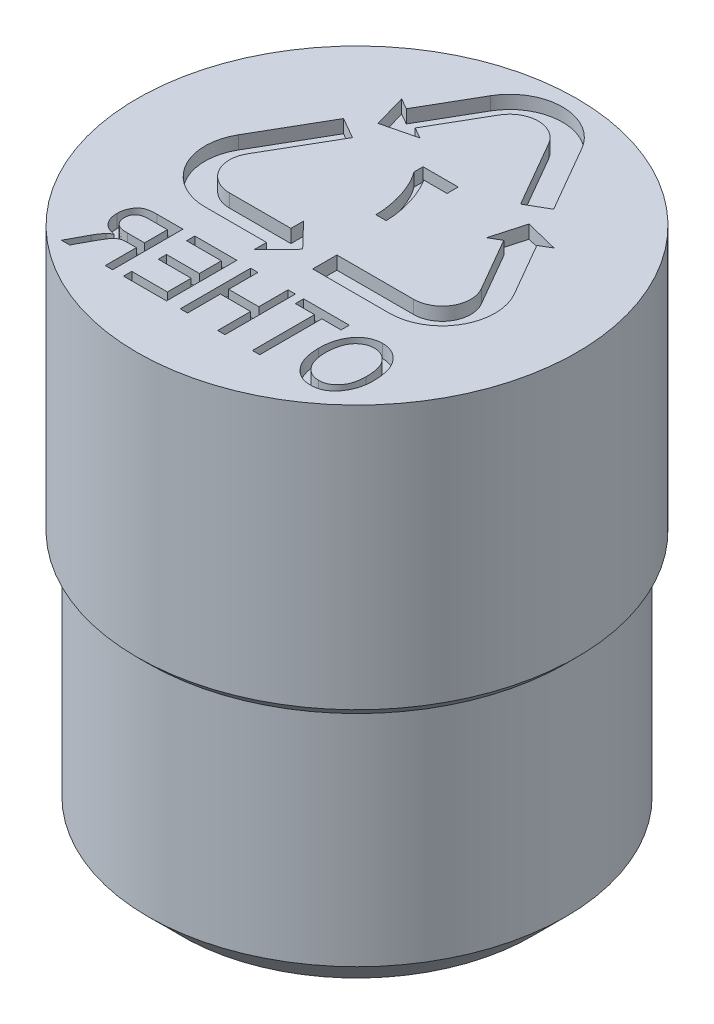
from build123d import *

# Parameters (mm, degrees)
CHAMFER1_SIZE             = 0.76
M5X0_8_TAPPED_HOLE1_D     = 4.2
M5X0_8_TAPPED_HOLE1_DEPTH = 6
CUT_EXTRUDE2_DEPTH        = 0.3
CUT_EXTRUDE3_DEPTH        = 0.3
CUT_EXTRUDE4_DEPTH        = 0.3


with BuildPart() as part:
    # Sketch1 → Revolve1 (revolve)
    with BuildSketch(Plane.XY, mode=Mode.PRIVATE) as revolve1_sk:
        Polygon((-5, 12), (-5, 6), (-4.745, 5.745), (-4.745, 0), (0, 0), (0, 12), align=None)
    revolve(revolve1_sk.sketch.rotate(Axis((0, 36.769771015, 0), (0, -1, 0)), 270), axis=Axis((0, 36.769771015, 0), (0, -1, 0)))

    # Chamfer1
    chamfer1_edges = [part.edges().sort_by_distance(p)[0] for p in [
        (0, 0, -4.745),
    ]]
    chamfer(chamfer1_edges, length=CHAMFER1_SIZE)

    # M5x0.8 Tapped Hole1
    with Locations(Plane(origin=(0, 0, 0), x_dir=(-1, 0, 0), z_dir=(0, -1, 0))):
        with Locations((0, 0)):
            Hole(M5X0_8_TAPPED_HOLE1_D / 2, depth=M5X0_8_TAPPED_HOLE1_DEPTH)

    # Sketch8 → Cut-Extrude2 (cut)
    with BuildSketch(Plane(origin=(0, 12, 0), x_dir=(1, 0, 0), z_dir=(0, 1, 0))):
        with BuildLine():
            Line((0.565270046, 3.793229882), (1.437916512, 2.281761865))
            Line((1.437916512, 2.281761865), (1.914230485, 2.556761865))
            Line((1.914230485, 2.556761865), (1.039230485, 4.072306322))
            ThreePointArc((1.039230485, 4.072306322), (0, 4.672306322), (-1.039230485, 4.072306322))
            Line((-1.039230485, 4.072306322), (-1.739230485, 2.859870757))
            Line((-1.739230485, 2.859870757), (-1.98753883, 3.003231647))
            Line((-1.98753883, 3.003231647), (-1.771443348, 2.25))
            Line((-1.771443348, 2.25), (-1.011077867, 2.439471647))
            Line((-1.011077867, 2.439471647), (-1.259386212, 2.582832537))
            Line((-1.259386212, 2.582832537), (-0.560562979, 3.793229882))
            ThreePointArc((-0.560562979, 3.793229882), (0.002353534, 4.118229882), (0.565270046, 3.793229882))
        make_face()
        with BuildLine():
            Line((-2.259600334, 1.954487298), (-3.134600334, 0.438942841))
            ThreePointArc((-3.134600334, 0.438942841), (-3.134600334, -0.761057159), (-2.09536985, -1.361057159))
            Line((-2.09536985, -1.361057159), (-0.69536985, -1.361057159))
            Line((-0.69536985, -1.361057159), (-0.69536985, -1.647778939))
            Line((-0.69536985, -1.647778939), (-0.15109985, -1.084018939))
            Line((-0.15109985, -1.084018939), (-0.69536985, -0.520258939))
            Line((-0.69536985, -0.520258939), (-0.69536985, -0.806980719))
            Line((-0.69536985, -0.806980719), (-2.093016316, -0.806980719))
            ThreePointArc((-2.093016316, -0.806980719), (-2.655932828, -0.481980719), (-2.655932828, 0.168019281))
            Line((-2.655932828, 0.168019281), (-1.783286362, 1.679487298))
            Line((-1.783286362, 1.679487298), (-2.259600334, 1.954487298))
        make_face()
        with BuildLine():
            Line((3.135508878, 0.441442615), (2.435774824, 1.653417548))
            Line((2.435774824, 1.653417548), (2.683606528, 1.797600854))
            Line((2.683606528, 1.797600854), (1.926073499, 1.986249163))
            Line((1.926073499, 1.986249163), (1.712543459, 1.232656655))
            Line((1.712543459, 1.232656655), (1.960375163, 1.376839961))
            Line((1.960375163, 1.376839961), (2.659198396, 0.166442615))
            ThreePointArc((2.659198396, 0.166442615), (2.659198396, -0.483557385), (2.096281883, -0.808557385))
            Line((2.096281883, -0.808557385), (0.350988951, -0.808557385))
            Line((0.350988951, -0.808557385), (0.350988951, -1.358557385))
            Line((0.350988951, -1.358557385), (2.096278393, -1.358557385))
            ThreePointArc((2.096278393, -1.358557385), (3.135508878, -0.758557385), (3.135508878, 0.441442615))
        make_face()
    extrude(amount=-CUT_EXTRUDE2_DEPTH, mode=Mode.SUBTRACT)

    # Sketch12 → Cut-Extrude3 (cut)
    with BuildSketch(Plane(origin=(0, 12, 0), x_dir=(1, 0, 0), z_dir=(0, 1, 0))):
        with BuildLine():
            Line((0.392077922, 1.655272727), (0.392077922, 1.908519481))
            Line((0.392077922, 1.908519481), (-0.406623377, 1.908519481))
            Line((-0.406623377, 1.908519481), (-0.406623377, 1.699712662))
            add(Edge.make_bspline(
                [(-0.406623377, 1.699712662), (-0.398278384, 1.689254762), (-0.381116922, 1.667748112), (-0.357032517, 1.632600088), (-0.331784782, 1.595113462), (-0.307450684, 1.55376717), (-0.282299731, 1.509832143), (-0.257838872, 1.462266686), (-0.232444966, 1.412043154), (-0.19919067, 1.340175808), (-0.159349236, 1.246748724), (-0.117715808, 1.130240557), (-0.081851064, 1.009790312), (-0.051802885, 0.887050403), (-0.028072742, 0.765216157), (-0.010561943, 0.647738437), (0.000446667, 0.535963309), (0.001806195, 0.463331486), (0.002467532, 0.428)],
                knots=[0, 0, 0, 0, 0.473354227, 0.97345203, 1.507272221, 2.072602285, 2.670769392, 3.298770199, 3.965211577, 4.662431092, 6.101005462, 7.5582634, 9.038592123, 10.547028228, 12.028736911, 13.429840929, 14.749755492, 16, 16, 16, 16], degree=3))
            Line((0.002467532, 0.428), (0.236233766, 0.428))
            add(Edge.make_bspline(
                [(0.236233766, 0.428), (0.235333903, 0.454898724), (0.233528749, 0.508858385), (0.226900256, 0.589655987), (0.217814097, 0.670465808), (0.205888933, 0.751165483), (0.191356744, 0.831909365), (0.17364525, 0.912489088), (0.153115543, 0.99305333), (0.130282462, 1.073345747), (0.104227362, 1.152471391), (0.076760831, 1.230288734), (0.04648101, 1.305891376), (0.014607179, 1.379825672), (-0.019771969, 1.451585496), (-0.056483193, 1.521282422), (-0.094602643, 1.58947317), (-0.122238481, 1.633370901), (-0.136026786, 1.655272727)],
                knots=[0, 0, 0, 0, 0.99531935, 1.996640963, 2.997456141, 4.002630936, 5.013275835, 6.031279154, 7.053396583, 8.087948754, 9.118033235, 10.134077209, 11.139644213, 12.129593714, 13.111515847, 14.081722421, 15.042916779, 16, 16, 16, 16], degree=3))
            Line((-0.136026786, 1.655272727), (0.392077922, 1.655272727))
        make_face()
    extrude(amount=-CUT_EXTRUDE3_DEPTH, mode=Mode.SUBTRACT)

    # Sketch13 → Cut-Extrude4 (cut)
    # profile 1 of 5: a face of its own
    with BuildSketch(Plane(origin=(0, 12, 0), x_dir=(1, 0, 0), z_dir=(0, 1, 0))):
        with BuildLine():
            add(Edge.make_bspline(
                [(3.246103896, -2.871103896), (3.24553875, -2.838294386), (3.244438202, -2.774402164), (3.23604908, -2.681508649), (3.2217985, -2.594489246), (3.202226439, -2.513260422), (3.176510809, -2.437968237), (3.145416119, -2.368320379), (3.108270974, -2.304641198), (3.065618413, -2.247209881), (3.019091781, -2.195921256), (2.969008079, -2.151467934), (2.916421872, -2.113453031), (2.86068131, -2.082878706), (2.802504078, -2.058284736), (2.741076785, -2.041823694), (2.677127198, -2.030819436), (2.633488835, -2.029758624), (2.611363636, -2.029220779)],
                knots=[0, 0, 0, 0, 1.331070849, 2.592086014, 3.780305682, 4.906005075, 5.978011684, 7.003908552, 7.995748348, 8.962674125, 9.901370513, 10.800246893, 11.675154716, 12.528146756, 13.374603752, 14.231114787, 15.103152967, 16, 16, 16, 16], degree=3))
            add(Edge.make_bspline(
                [(2.611363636, -2.029220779), (2.596848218, -2.029542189), (2.568179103, -2.030177), (2.525663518, -2.034957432), (2.48413427, -2.042182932), (2.443627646, -2.053175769), (2.403922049, -2.066680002), (2.365313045, -2.083619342), (2.327774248, -2.103667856), (2.291152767, -2.126188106), (2.256010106, -2.151956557), (2.222620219, -2.180532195), (2.190935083, -2.21179779), (2.161459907, -2.246000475), (2.133703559, -2.282815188), (2.108128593, -2.322496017), (2.084385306, -2.364943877), (2.062367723, -2.409874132), (2.042550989, -2.457326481), (2.025231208, -2.507047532), (2.011195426, -2.559214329), (1.998973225, -2.613315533), (1.990127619, -2.669856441), (1.983166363, -2.728425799), (1.979314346, -2.789341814), (1.978821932, -2.830622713), (1.978571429, -2.851623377)],
                knots=[0, 0, 0, 0, 0.899824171, 1.777224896, 2.649917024, 3.510973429, 4.376801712, 5.248254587, 6.121797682, 7.013780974, 7.911701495, 8.820786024, 9.736582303, 10.668970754, 11.617827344, 12.593151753, 13.593637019, 14.632021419, 15.69381936, 16.780371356, 17.893899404, 19.04171746, 20.217729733, 21.440466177, 22.69789874, 24, 24, 24, 24], degree=3))
            add(Edge.make_bspline(
                [(1.978571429, -2.851623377), (1.979093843, -2.880316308), (1.980116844, -2.936503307), (1.987420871, -3.018798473), (2.000703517, -3.09691263), (2.017781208, -3.171245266), (2.041037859, -3.241214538), (2.069037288, -3.307174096), (2.101884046, -3.36931297), (2.128393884, -3.407389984), (2.141558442, -3.426298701)],
                knots=[0, 0, 0, 0, 1.133525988, 2.219690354, 3.25996653, 4.261750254, 5.229810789, 6.168477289, 7.090481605, 8, 8, 8, 8], degree=3))
            add(Edge.make_bspline(
                [(2.141558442, -3.426298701), (2.156744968, -3.445687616), (2.186428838, -3.483585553), (2.236917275, -3.533693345), (2.290898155, -3.576007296), (2.348275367, -3.611086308), (2.409446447, -3.63765478), (2.473924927, -3.65700261), (2.542009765, -3.668562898), (2.588591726, -3.670030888), (2.612337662, -3.670779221)],
                knots=[0, 0, 0, 0, 1.070119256, 2.09167529, 3.083880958, 4.046692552, 5.007570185, 5.975302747, 6.967876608, 8, 8, 8, 8], degree=3))
            add(Edge.make_bspline(
                [(2.612337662, -3.670779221), (2.636195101, -3.670057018), (2.683016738, -3.668639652), (2.751555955, -3.656672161), (2.81638733, -3.636791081), (2.877860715, -3.609372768), (2.935351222, -3.573558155), (2.989170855, -3.529937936), (3.03966197, -3.478726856), (3.069047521, -3.439755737), (3.084090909, -3.419805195)],
                knots=[0, 0, 0, 0, 1.027712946, 2.016947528, 2.987811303, 3.944031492, 4.90967079, 5.89821231, 6.924028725, 8, 8, 8, 8], degree=3))
            add(Edge.make_bspline(
                [(3.084090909, -3.419805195), (3.097104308, -3.400540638), (3.123054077, -3.362125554), (3.155789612, -3.300464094), (3.183868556, -3.23614763), (3.206432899, -3.168714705), (3.224514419, -3.098557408), (3.237004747, -3.025365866), (3.24459107, -2.949186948), (3.245594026, -2.897420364), (3.246103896, -2.871103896)],
                knots=[0, 0, 0, 0, 0.958933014, 1.912189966, 2.876424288, 3.85247362, 4.843745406, 5.863745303, 6.913996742, 8, 8, 8, 8], degree=3))
        make_face()
        with BuildLine():
            add(Edge.make_bspline(
                [(3.07987013, -2.873701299), (3.079398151, -2.897198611), (3.078480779, -2.942869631), (3.072408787, -3.009418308), (3.061733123, -3.07194637), (3.046795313, -3.130447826), (3.02818748, -3.185094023), (3.004590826, -3.235381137), (2.97694151, -3.281787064), (2.945158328, -3.323943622), (2.910200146, -3.361313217), (2.873447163, -3.394238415), (2.834439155, -3.421505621), (2.794103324, -3.44462362), (2.751554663, -3.46228611), (2.707144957, -3.47450205), (2.660985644, -3.482275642), (2.629576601, -3.483264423), (2.613636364, -3.483766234)],
                knots=[0, 0, 0, 0, 1.312267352, 2.550614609, 3.728111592, 4.851026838, 5.919546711, 6.947055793, 7.94734328, 8.931337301, 9.889295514, 10.801324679, 11.681722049, 12.542374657, 13.393208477, 14.246700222, 15.110192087, 16, 16, 16, 16], degree=3))
            add(Edge.make_bspline(
                [(2.613636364, -3.483766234), (2.597374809, -3.483248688), (2.565219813, -3.482225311), (2.518023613, -3.47465061), (2.472855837, -3.462031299), (2.429964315, -3.443802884), (2.388932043, -3.421109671), (2.349959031, -3.393191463), (2.313184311, -3.360103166), (2.27843622, -3.32225321), (2.246973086, -3.279264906), (2.219127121, -3.23164152), (2.196147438, -3.17892663), (2.177538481, -3.121553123), (2.162395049, -3.059630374), (2.152470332, -2.992786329), (2.145642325, -2.921354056), (2.145089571, -2.872095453), (2.144805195, -2.846753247)],
                knots=[0, 0, 0, 0, 0.878770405, 1.737648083, 2.57658969, 3.407764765, 4.250999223, 5.106523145, 5.993164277, 6.920704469, 7.879005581, 8.867335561, 9.896730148, 10.980825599, 12.124467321, 13.338272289, 14.63061378, 16, 16, 16, 16], degree=3))
            add(Edge.make_bspline(
                [(2.144805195, -2.846753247), (2.144963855, -2.83008152), (2.14527634, -2.797246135), (2.148608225, -2.748588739), (2.154193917, -2.701380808), (2.161393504, -2.65533651), (2.171825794, -2.610949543), (2.18318166, -2.567529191), (2.19758638, -2.525659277), (2.208742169, -2.498540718), (2.214285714, -2.485064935)],
                knots=[0, 0, 0, 0, 1.078644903, 2.124418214, 3.153743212, 4.154196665, 5.137842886, 6.102739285, 7.057211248, 8, 8, 8, 8], degree=3))
            add(Edge.make_bspline(
                [(2.214285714, -2.485064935), (2.223653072, -2.465355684), (2.242164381, -2.426407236), (2.280010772, -2.374288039), (2.323821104, -2.327719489), (2.374401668, -2.288662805), (2.42897495, -2.256271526), (2.487060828, -2.232945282), (2.547808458, -2.21880861), (2.589211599, -2.217096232), (2.610064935, -2.216233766)],
                knots=[0, 0, 0, 0, 1.032714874, 2.040800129, 3.038924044, 4.055125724, 5.060150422, 6.038733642, 7.012177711, 8, 8, 8, 8], degree=3))
            add(Edge.make_bspline(
                [(2.610064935, -2.216233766), (2.626757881, -2.216750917), (2.659664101, -2.217770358), (2.707849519, -2.225284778), (2.753682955, -2.238042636), (2.797201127, -2.255784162), (2.838694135, -2.278116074), (2.877602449, -2.306202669), (2.914326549, -2.33902291), (2.948516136, -2.376970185), (2.980061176, -2.419744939), (3.006419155, -2.46885972), (3.029678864, -2.522723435), (3.047908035, -2.582467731), (3.062657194, -2.647436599), (3.072111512, -2.718078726), (3.079091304, -2.794017), (3.079604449, -2.846518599), (3.07987013, -2.873701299)],
                knots=[0, 0, 0, 0, 0.879508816, 1.733744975, 2.562624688, 3.381316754, 4.205651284, 5.039714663, 5.904114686, 6.796492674, 7.727389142, 8.697387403, 9.727116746, 10.814853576, 11.984051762, 13.234256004, 14.568036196, 16, 16, 16, 16], degree=3))
        make_face(mode=Mode.SUBTRACT)
    # profile 2 of 5: a face of its own
    with BuildSketch(Plane(origin=(0, 12, 0), x_dir=(1, 0, 0), z_dir=(0, 1, 0))):
        Polygon((1.438311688, -3.65), (1.438311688, -2.237012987), (1.874675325, -2.237012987), (1.874675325, -2.05), (0.835714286, -2.05), (0.835714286, -2.237012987), (1.272077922, -2.237012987), (1.272077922, -3.65), align=None)
    # profile 3 of 5: a face of its own
    with BuildSketch(Plane(origin=(0, 12, 0), x_dir=(1, 0, 0), z_dir=(0, 1, 0))):
        Polygon((0.648701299, -3.65), (0.648701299, -2.05), (0.482467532, -2.05), (0.482467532, -2.714935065), (-0.203246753, -2.714935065), (-0.203246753, -2.05), (-0.369480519, -2.05), (-0.369480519, -3.65), (-0.203246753, -3.65), (-0.203246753, -2.901948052), (0.482467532, -2.901948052), (0.482467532, -3.65), align=None)
    # profile 4 of 5: a face of its own
    with BuildSketch(Plane(origin=(0, 12, 0), x_dir=(1, 0, 0), z_dir=(0, 1, 0))):
        Polygon((-0.681168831, -3.65), (-0.681168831, -2.05), (-1.637012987, -2.05), (-1.637012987, -2.237012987), (-0.847402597, -2.237012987), (-0.847402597, -2.735714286), (-1.595454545, -2.735714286), (-1.595454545, -2.922727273), (-0.847402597, -2.922727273), (-0.847402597, -3.462987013), (-1.657792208, -3.462987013), (-1.657792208, -3.65), align=None)
    # profile 5 of 5: a face of its own
    with BuildSketch(Plane(origin=(0, 12, 0), x_dir=(1, 0, 0), z_dir=(0, 1, 0))):
        with BuildLine():
            Line((-1.907142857, -3.65), (-1.907142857, -2.05))
            Line((-1.907142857, -2.05), (-2.494805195, -2.05))
            add(Edge.make_bspline(
                [(-2.494805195, -2.05), (-2.509635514, -2.050085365), (-2.538341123, -2.050250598), (-2.579925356, -2.052627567), (-2.618592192, -2.056146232), (-2.654290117, -2.060824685), (-2.686810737, -2.067310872), (-2.716283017, -2.075179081), (-2.742946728, -2.083961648), (-2.774248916, -2.098448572), (-2.809960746, -2.120919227), (-2.848475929, -2.155154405), (-2.88221209, -2.197550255), (-2.912232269, -2.246261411), (-2.936885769, -2.300952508), (-2.954348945, -2.360596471), (-2.96489112, -2.424409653), (-2.966207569, -2.468357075), (-2.966883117, -2.490909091)],
                knots=[0, 0, 0, 0, 0.957775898, 1.853873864, 2.6892683, 3.465319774, 4.178195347, 4.829309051, 5.435011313, 5.988660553, 7.053440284, 8.147710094, 9.30058322, 10.540256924, 11.835580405, 13.162637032, 14.543981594, 16, 16, 16, 16], degree=3))
            add(Edge.make_bspline(
                [(-2.966883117, -2.490909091), (-2.966529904, -2.505853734), (-2.965839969, -2.535045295), (-2.961660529, -2.577830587), (-2.954397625, -2.618414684), (-2.943290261, -2.656692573), (-2.930408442, -2.69313992), (-2.913492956, -2.727117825), (-2.894085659, -2.759065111), (-2.871528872, -2.788727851), (-2.846298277, -2.816039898), (-2.817982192, -2.840571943), (-2.787131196, -2.862672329), (-2.753504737, -2.882147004), (-2.717310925, -2.899245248), (-2.678121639, -2.912888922), (-2.63654765, -2.924837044), (-2.607629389, -2.930317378), (-2.592857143, -2.933116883)],
                knots=[0, 0, 0, 0, 1.121977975, 2.191573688, 3.224240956, 4.211948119, 5.180998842, 6.122125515, 7.055751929, 7.983633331, 8.914994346, 9.842128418, 10.791356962, 11.759862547, 12.75578979, 13.791489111, 14.871831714, 16, 16, 16, 16], degree=3))
            add(Edge.make_bspline(
                [(-2.592857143, -2.933116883), (-2.603760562, -2.939149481), (-2.624516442, -2.950633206), (-2.65292162, -2.969161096), (-2.677197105, -2.987810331), (-2.690920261, -3.001381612), (-2.697402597, -3.007792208)],
                knots=[0, 0, 0, 0, 1.158843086, 2.205987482, 3.152571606, 4, 4, 4, 4], degree=3))
            add(Edge.make_bspline(
                [(-2.697402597, -3.007792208), (-2.71036816, -3.023442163), (-2.736445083, -3.054918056), (-2.772192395, -3.105133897), (-2.806433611, -3.157372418), (-2.826541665, -3.194119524), (-2.836688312, -3.212662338)],
                knots=[0, 0, 0, 0, 0.982253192, 1.975551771, 2.978451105, 4, 4, 4, 4], degree=3))
            Line((-2.836688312, -3.212662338), (-3.070779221, -3.65))
            Line((-3.070779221, -3.65), (-2.881818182, -3.65))
            Line((-2.881818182, -3.65), (-2.697077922, -3.307792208))
            add(Edge.make_bspline(
                [(-2.697077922, -3.307792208), (-2.688471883, -3.291746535), (-2.672010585, -3.261054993), (-2.647580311, -3.217477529), (-2.62487066, -3.178177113), (-2.603919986, -3.143115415), (-2.584417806, -3.112664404), (-2.566902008, -3.086405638), (-2.550860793, -3.064638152), (-2.531661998, -3.042211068), (-2.509346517, -3.018963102), (-2.482818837, -2.995614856), (-2.456321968, -2.977514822), (-2.429344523, -2.963731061), (-2.399648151, -2.954650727), (-2.366186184, -2.94785398), (-2.327461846, -2.944157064), (-2.300007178, -2.943732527), (-2.28538961, -2.943506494)],
                knots=[0, 0, 0, 0, 1.483643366, 2.83785556, 4.070616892, 5.1822306, 6.165666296, 7.016844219, 7.754091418, 8.367230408, 9.421242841, 10.377779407, 11.241203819, 12.029974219, 12.835959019, 13.762973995, 14.808950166, 16, 16, 16, 16], degree=3))
            Line((-2.28538961, -2.943506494), (-2.073376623, -2.943506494))
            Line((-2.073376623, -2.943506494), (-2.073376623, -3.65))
            Line((-2.073376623, -3.65), (-1.907142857, -3.65))
        make_face()
        with BuildLine():
            Line((-2.073376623, -2.756493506), (-2.463311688, -2.756493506))
            add(Edge.make_bspline(
                [(-2.463311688, -2.756493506), (-2.483343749, -2.75610328), (-2.520885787, -2.755371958), (-2.573407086, -2.750514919), (-2.618235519, -2.74172551), (-2.656208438, -2.728924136), (-2.688588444, -2.711961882), (-2.716779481, -2.690956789), (-2.741506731, -2.665870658), (-2.762539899, -2.636853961), (-2.779930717, -2.60454037), (-2.791668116, -2.56901844), (-2.799634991, -2.531306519), (-2.800305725, -2.505238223), (-2.800649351, -2.491883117)],
                knots=[0, 0, 0, 0, 1.47306528, 2.760668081, 3.873497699, 4.82484281, 5.696997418, 6.550136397, 7.399890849, 8.276969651, 9.17766846, 10.086208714, 11.019541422, 12, 12, 12, 12], degree=3))
            add(Edge.make_bspline(
                [(-2.800649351, -2.491883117), (-2.800349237, -2.482244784), (-2.799764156, -2.463454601), (-2.7966858, -2.436003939), (-2.790677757, -2.41017212), (-2.782750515, -2.385820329), (-2.772092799, -2.363171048), (-2.759647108, -2.341866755), (-2.743973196, -2.32278335), (-2.726916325, -2.304717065), (-2.707176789, -2.288678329), (-2.685132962, -2.274781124), (-2.660789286, -2.26310722), (-2.634379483, -2.253097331), (-2.605367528, -2.246439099), (-2.574433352, -2.240672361), (-2.541192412, -2.237475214), (-2.518296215, -2.237170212), (-2.506493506, -2.237012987)],
                knots=[0, 0, 0, 0, 1.045235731, 2.037714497, 2.988326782, 3.915852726, 4.808207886, 5.697550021, 6.58254782, 7.478674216, 8.387536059, 9.331464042, 10.296946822, 11.310355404, 12.385965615, 13.518246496, 14.720686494, 16, 16, 16, 16], degree=3))
            Line((-2.506493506, -2.237012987), (-2.073376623, -2.237012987))
            Line((-2.073376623, -2.237012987), (-2.073376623, -2.756493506))
        make_face(mode=Mode.SUBTRACT)
    extrude(amount=-CUT_EXTRUDE4_DEPTH, mode=Mode.SUBTRACT)


solid = part.part
